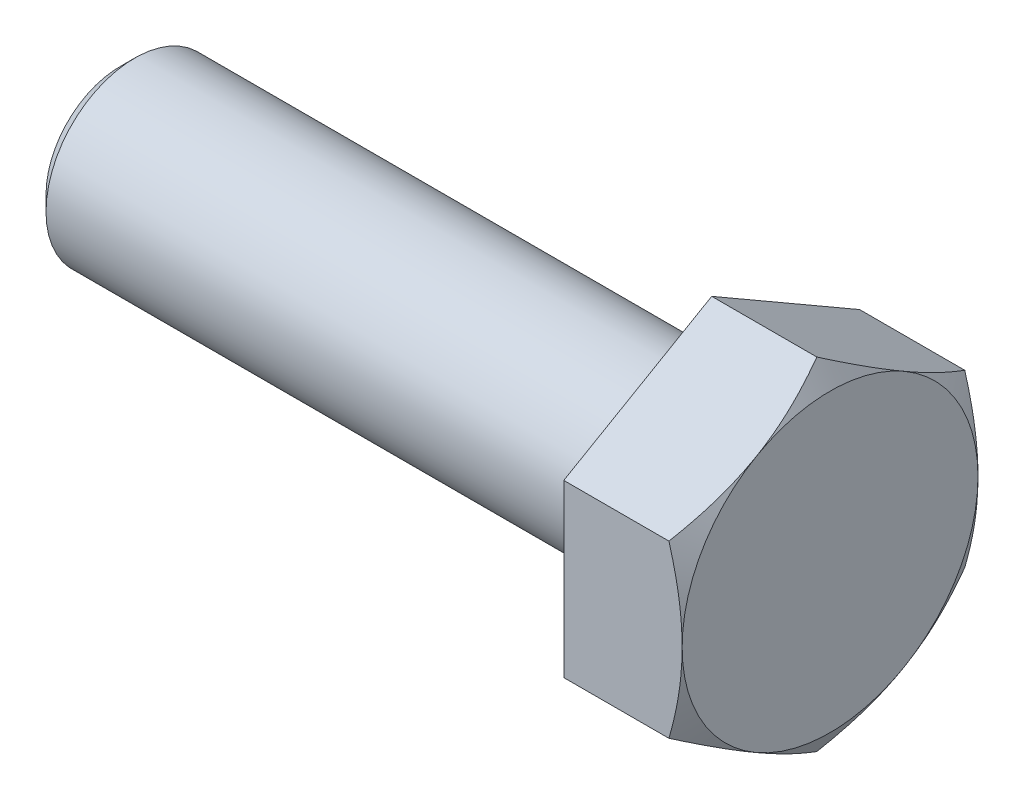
from build123d import *

# Parameters (mm, degrees)
ESQUISSE1_W            = 20
ESQUISSE1_H            = 3
CHANFREIN_DE_TIGE_SIZE = 0.5
T_TE_DEPTH             = 4


with BuildPart() as part:
    # Esquisse1 → Tige (revolve)
    with BuildSketch(Plane.XY, mode=Mode.PRIVATE) as tige_sk:
        with Locations((-10, 1.5)):
            Rectangle(ESQUISSE1_W, ESQUISSE1_H)
    revolve(tige_sk.sketch.rotate(Axis((-110, 0, 0), (1, 0, 0)), 90), axis=Axis((-110, 0, 0), (1, 0, 0)))

    # Chanfrein de tige
    chanfrein_de_tige_edges = [part.edges().sort_by_distance(p)[0] for p in [
        (-20, 0, -3),
    ]]
    chamfer(chanfrein_de_tige_edges, length=CHANFREIN_DE_TIGE_SIZE)

    # Esquisse2 → T_te (add)
    with BuildSketch(Plane(origin=(0, 0, 0), x_dir=(0, 0, -1), z_dir=(1, 0, 0))):
        Polygon((0, 5.773502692), (5, 2.886751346), (5, -2.886751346), (0, -5.773502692), (-5, -2.886751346), (-5, 2.886751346), align=None)
    extrude(amount=T_TE_DEPTH)

    # Esquisse4 → Chanfrein de t_te (revolve, cut)
    with BuildSketch(Plane.XY):
        Polygon((3.553418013, 5.773502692), (4, 5.773502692), (4, 5), align=None)
    revolve(axis=Axis((16, 0, 0), (-1, 0, 0)), mode=Mode.SUBTRACT)


solid = part.part
